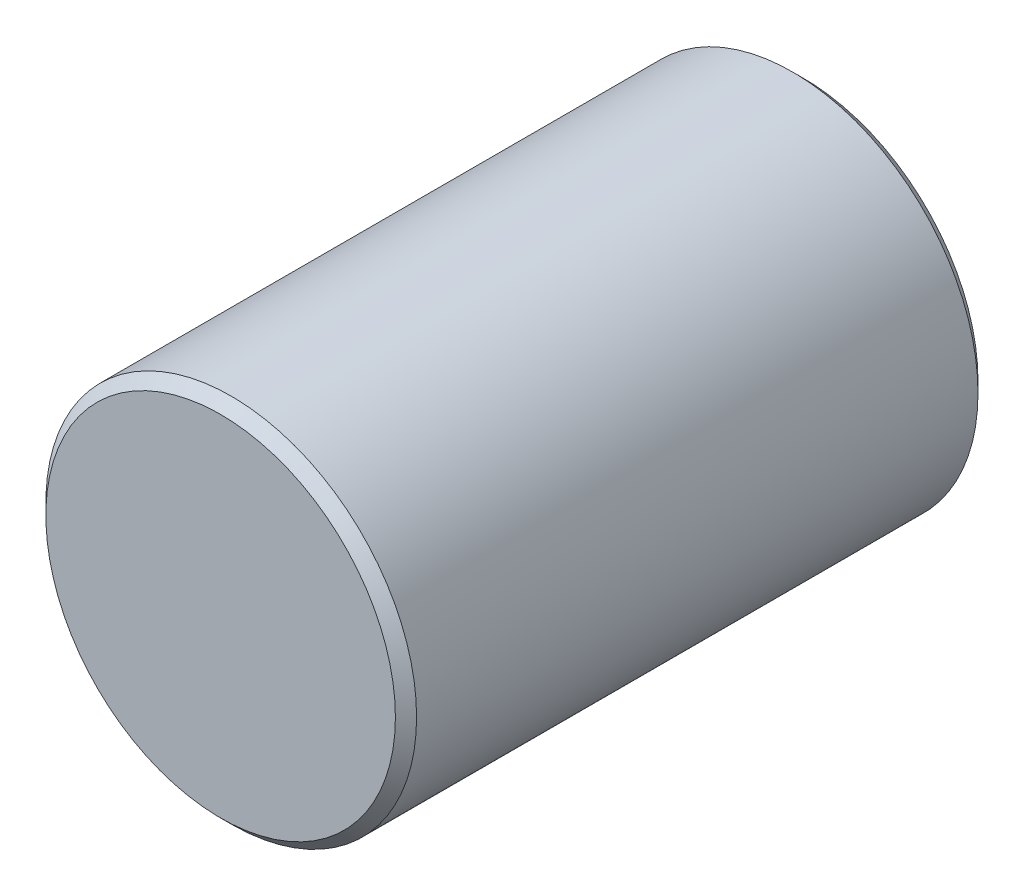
from build123d import *

# Parameters (mm, degrees)
ESQUISSE1_R               = 17.5
EXTRUSION1_DEPTH          = 55
CHANFREIN1_SIZE           = 1
TROU_TARAUD_M6X1_02_D     = 5
TROU_TARAUD_M6X1_02_DEPTH = 15
TROU_TARAUD_M6X1_02_TIP   = 1.502151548


with BuildPart() as part:
    # Esquisse1 → Extrusion1 (new body)
    with BuildSketch(Plane.XY):
        Circle(ESQUISSE1_R)
    extrude(amount=EXTRUSION1_DEPTH)

    # Chanfrein1
    chanfrein1_edges = [part.edges().sort_by_distance(p)[0] for p in [
        (-17.5, 0, 0),
        (-17.5, 0, 55),
    ]]
    chamfer(chanfrein1_edges, length=CHANFREIN1_SIZE)

    # Trou taraud_ M6x1.02
    with Locations(Plane(origin=(0, 0, 0), x_dir=(-1, 0, 0), z_dir=(0, 0, -1))):
        with Locations((0, 0)):
            Hole(TROU_TARAUD_M6X1_02_D / 2, depth=TROU_TARAUD_M6X1_02_DEPTH)
            with Locations((0, 0, -(TROU_TARAUD_M6X1_02_DEPTH + TROU_TARAUD_M6X1_02_TIP / 2))):  # 118° drill point
                Cone(0, TROU_TARAUD_M6X1_02_D / 2, TROU_TARAUD_M6X1_02_TIP, mode=Mode.SUBTRACT)


solid = part.part
